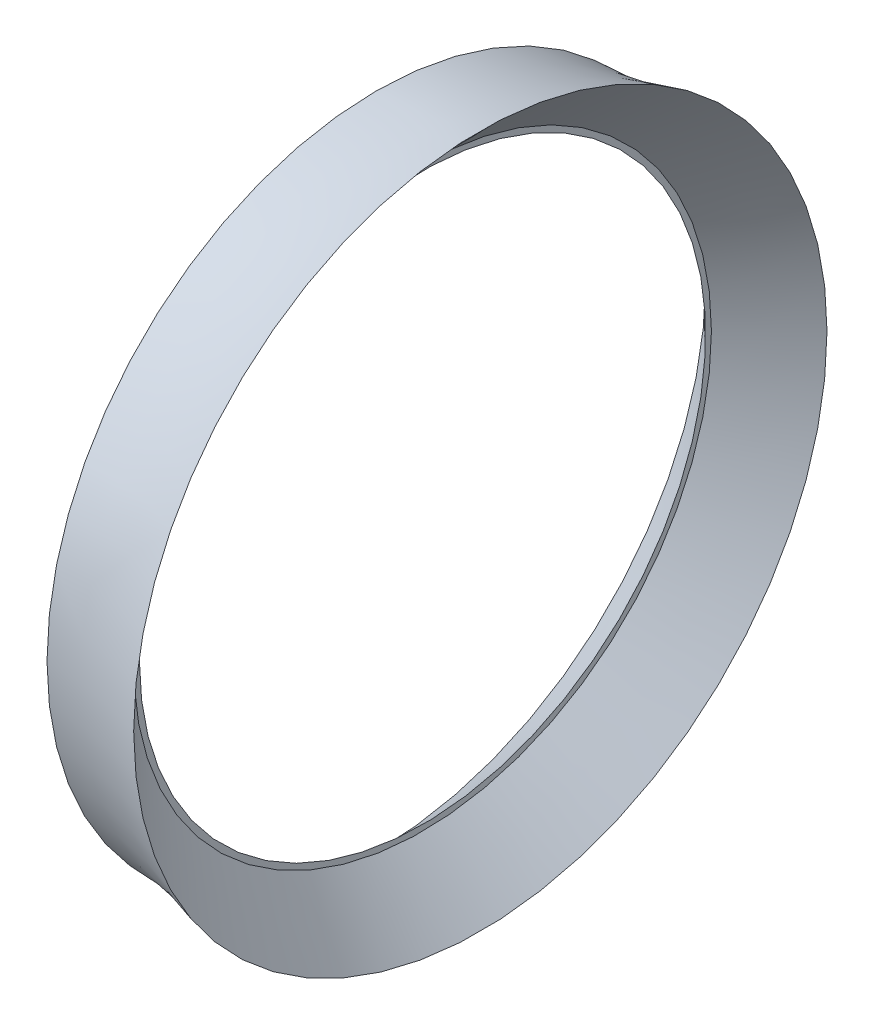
from build123d import *


with BuildPart() as part:
    # Esquisse1 → R_volution1 (revolve)
    with BuildSketch(Plane.XY, mode=Mode.PRIVATE) as r_volution1_sk:
        with BuildLine():
            Line((-77.5, 100.505035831), (-80, 98.005035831))
            Line((-80, 98.005035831), (-80, 97.755035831))
            Line((-80, 97.755035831), (-82, 99.755035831))
            ThreePointArc((-82, 99.755035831), (-79.718964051, 99.943820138), (-77.5, 100.505035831))
        make_face()
    revolve(r_volution1_sk.sketch.rotate(Axis((-55, 85.505035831, 0), (-1, 0, 0)), 90), axis=Axis((-55, 85.505035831, 0), (-1, 0, 0)))


solid = part.part
